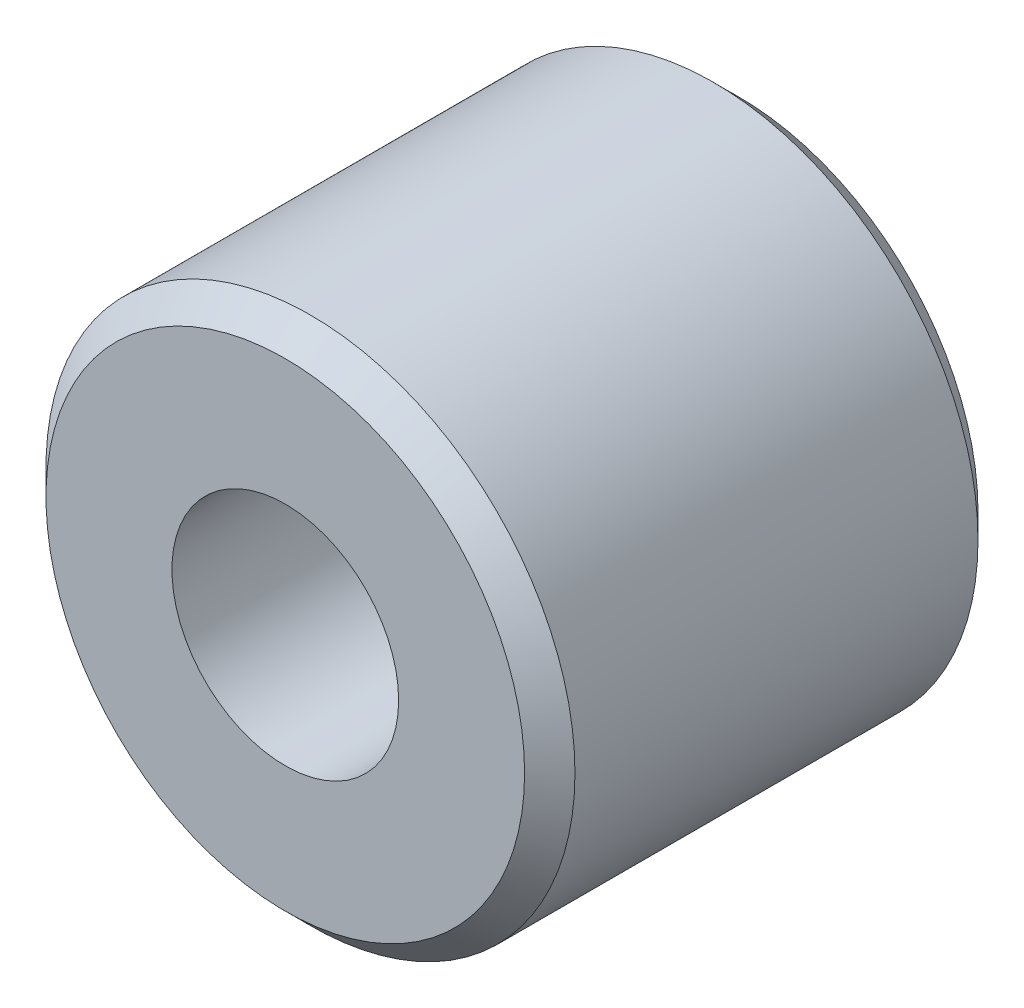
from build123d import *

# Parameters (mm, degrees)
ESQUISSE1_R      = 21
ESQUISSE1_R_2    = 9
EXTRUSION1_DEPTH = 36
CHANFREIN1_SIZE  = 2


with BuildPart() as part:
    # Esquisse1 → Extrusion1 (new body)
    with BuildSketch(Plane.XY):
        Circle(ESQUISSE1_R)
        Circle(ESQUISSE1_R_2, mode=Mode.SUBTRACT)
    extrude(amount=EXTRUSION1_DEPTH)

    # Chanfrein1
    chanfrein1_edges = [part.edges().sort_by_distance(p)[0] for p in [
        (-21, 0, 0),
        (-21, 0, 36),
    ]]
    chamfer(chanfrein1_edges, length=CHANFREIN1_SIZE)


solid = part.part
